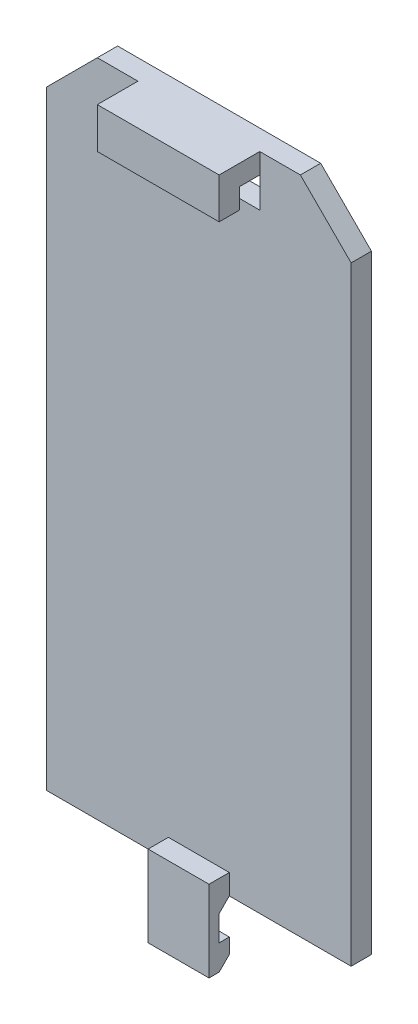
from build123d import *

# Parameters (mm, degrees)
EXTRUSION1_DEPTH        = 2
ENL_V_MAT_EXTRU_1_REACH = 68.738
ESQUISSE3_W             = 12
ESQUISSE3_H             = 3
EXTRUSION2_DEPTH        = 6
EXTRUSION3_DEPTH        = 3
ESQUISSE6_W             = 1
ESQUISSE6_H             = 3
ENL_V_MAT_EXTRU_2_DEPTH = 8


with BuildPart() as part:
    # Esquisse1 → Extrusion1 (new body)
    with BuildSketch(Plane.XY):
        Polygon((-15, 60), (-10, 65), (10, 65), (15, 60), (15, 0), (-15, 0), align=None)
    extrude(amount=EXTRUSION1_DEPTH)

    # Esquisse3 → Enl_v. mat.-Extru.1 (cut, up to next)
    with BuildSketch(Plane.XY.offset(2), mode=Mode.PRIVATE) as enl_v_mat_extru_1_sk1:
        with Locations((0, 61.5)):
            Rectangle(ESQUISSE3_W, ESQUISSE3_H)
    enl_v_mat_extru_1_tool1 = extrude(enl_v_mat_extru_1_sk1.sketch, amount=-ENL_V_MAT_EXTRU_1_REACH, mode=Mode.PRIVATE) & part.part
    add(enl_v_mat_extru_1_tool1.solids().sort_by_distance((0, 61.5, 2))[0], mode=Mode.SUBTRACT)

    # Esquisse4 → Extrusion2 (add, symmetric)
    with BuildSketch(Plane(origin=(0, 0, 0), x_dir=(0, 0, -1), z_dir=(1, 0, 0))):
        Polygon((-2, 63), (-4, 63), (-4, 61), (-6, 61), (-6, 65), (-2, 65), align=None)
    extrude(amount=EXTRUSION2_DEPTH, both=True)

    # Esquisse5 → Extrusion3 (add, symmetric)
    with BuildSketch(Plane(origin=(0, 0, 0), x_dir=(0, 0, -1), z_dir=(1, 0, 0))):
        Polygon((-2, 2), (-4, 2), (-4, -6), (-3, -6), (-2, -5), (-2, -3.5), (-3, -3.5), (-3, -1), (-2, 0), align=None)
    extrude(amount=EXTRUSION3_DEPTH, both=True)

    # Esquisse6 → Enl_v. mat.-Extru.2 (cut, symmetric)
    with BuildSketch(Plane(origin=(0, 0, 0), x_dir=(0, 0, -1), z_dir=(1, 0, 0))):
        with Locations((-0.5, 6.5)):
            Rectangle(ESQUISSE6_W, ESQUISSE6_H)
        Polygon((0, 8.2), (-1, 10), (0, 10), align=None)
        Polygon((0, 10.2), (-1, 12), (0, 12), align=None)
        Polygon((0, 12.2), (-1, 14), (0, 14), align=None)
        Polygon((0, 14.2), (-1, 16), (0, 16), align=None)
    extrude(amount=ENL_V_MAT_EXTRU_2_DEPTH, both=True, mode=Mode.SUBTRACT)


solid = part.part
